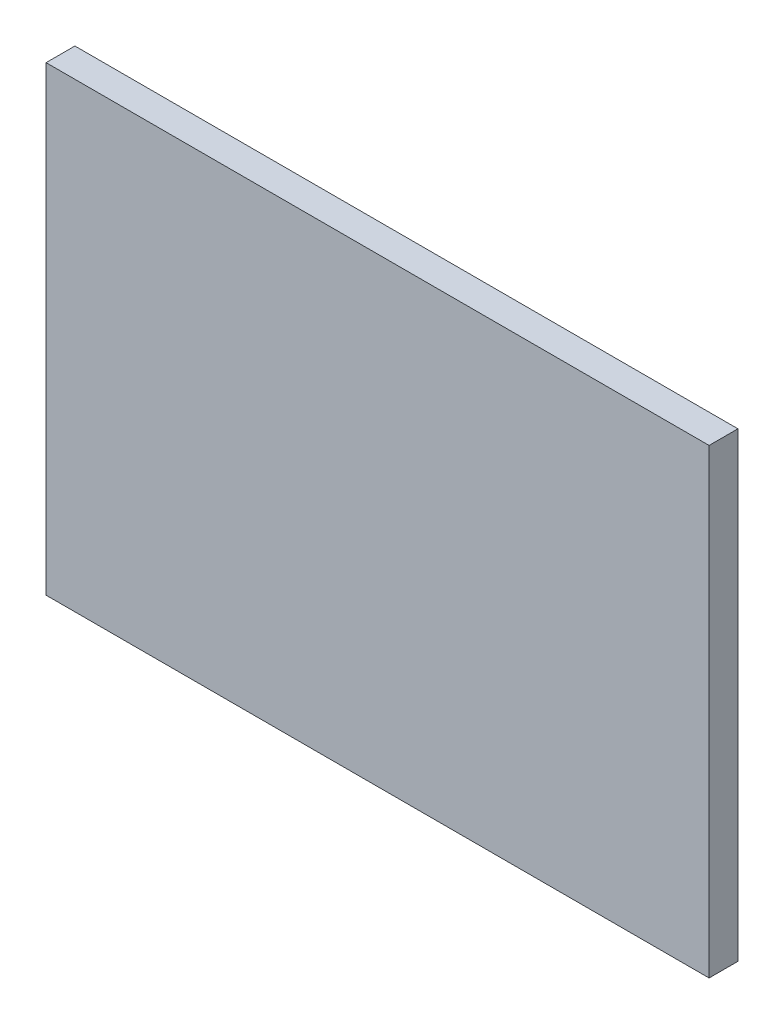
from build123d import *

# Parameters (mm, degrees)
SKETCH1_W           = 146.05
SKETCH1_H           = 101.6
BOSS_EXTRUDE1_DEPTH = 6.35


with BuildPart() as part:
    # Sketch1 → Boss-Extrude1 (new body)
    with BuildSketch(Plane.XY):
        Rectangle(SKETCH1_W, SKETCH1_H)
    extrude(amount=BOSS_EXTRUDE1_DEPTH)


solid = part.part
